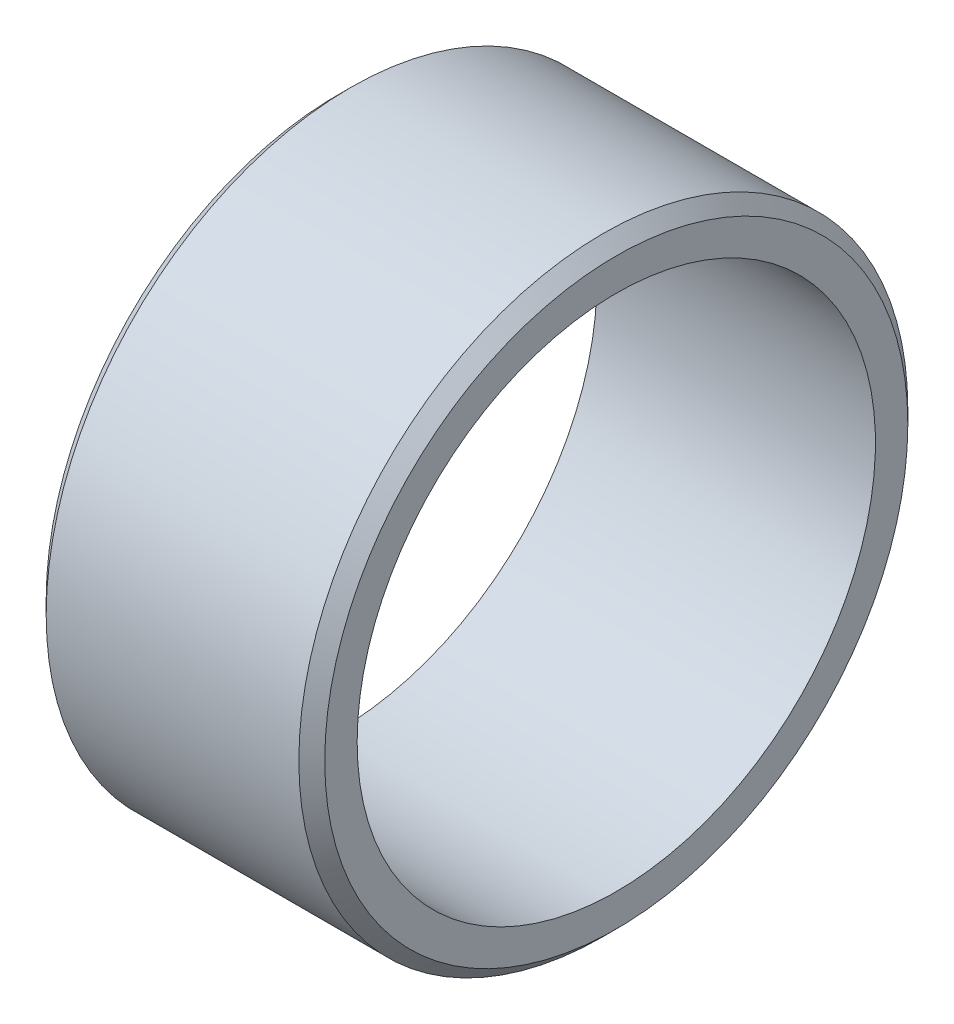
from build123d import *


with BuildPart() as part:
    # Esquisse1 → R_volution1 (revolve)
    with BuildSketch(Plane.XY, mode=Mode.PRIVATE) as r_volution1_sk:
        Polygon((-1, 23.5), (0, 22.5), (0, 20), (-21.5, 20), (-21.5, 22.5), (-20.5, 23.5), align=None)
    revolve(r_volution1_sk.sketch.rotate(Axis((-20.6639399, 0, 0), (1, 0, 0)), 90), axis=Axis((-20.6639399, 0, 0), (1, 0, 0)))


solid = part.part
